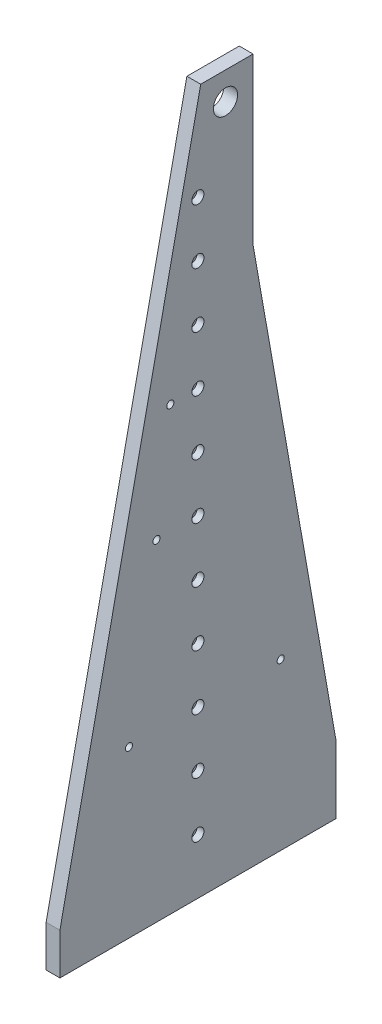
ISO-10303-21;
HEADER;
FILE_DESCRIPTION(('STEP AP214'),'2;1');
FILE_NAME('part.step','',(''),(''),'','','');
FILE_SCHEMA(('AUTOMOTIVE_DESIGN { 1 0 10303 214 1 1 1 1 }'));
ENDSEC;
DATA;
#1=APPLICATION_CONTEXT('core data for automotive mechanical design processes');
#2=APPLICATION_PROTOCOL_DEFINITION('international standard','automotive_design',2000,#1);
#3=PRODUCT_CONTEXT('',#1,'mechanical');
#4=PRODUCT('Part','Part','',(#3));
#5=PRODUCT_RELATED_PRODUCT_CATEGORY('part','',(#4));
#6=PRODUCT_DEFINITION_FORMATION('','',#4);
#7=PRODUCT_DEFINITION_CONTEXT('part definition',#1,'design');
#8=PRODUCT_DEFINITION('design','',#6,#7);
#9=PRODUCT_DEFINITION_SHAPE('','',#8);
#10=(LENGTH_UNIT() NAMED_UNIT(*) SI_UNIT(.MILLI.,.METRE.));
#11=(NAMED_UNIT(*) PLANE_ANGLE_UNIT() SI_UNIT($,.RADIAN.));
#12=(NAMED_UNIT(*) SI_UNIT($,.STERADIAN.) SOLID_ANGLE_UNIT());
#13=UNCERTAINTY_MEASURE_WITH_UNIT(LENGTH_MEASURE(1.E-05),#10,'distance_accuracy_value','');
#14=(GEOMETRIC_REPRESENTATION_CONTEXT(3) GLOBAL_UNCERTAINTY_ASSIGNED_CONTEXT((#13)) GLOBAL_UNIT_ASSIGNED_CONTEXT((#10,
#11,#12)) REPRESENTATION_CONTEXT('',''));
#15=CARTESIAN_POINT('',(0.,0.,0.));
#16=DIRECTION('',(0.,0.,1.));
#17=DIRECTION('',(1.,0.,0.));
#18=AXIS2_PLACEMENT_3D('',#15,#16,#17);
#19=CARTESIAN_POINT('',(12.7,38.1,127.));
#20=DIRECTION('',(0.,-0.20791169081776,-0.978147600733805));
#21=DIRECTION('',(0.,0.978147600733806,-0.20791169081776));
#22=AXIS2_PLACEMENT_3D('',#19,#20,#21);
#23=PLANE('',#22);
#24=DIRECTION('',(0.,-0.978147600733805,0.20791169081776));
#25=VECTOR('',#24,1.);
#26=CARTESIAN_POINT('',(0.,38.1,127.));
#27=LINE('',#26,#25);
#28=CARTESIAN_POINT('',(0.,647.7,-2.57447999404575));
#29=VERTEX_POINT('',#28);
#30=CARTESIAN_POINT('',(0.,38.1,127.));
#31=VERTEX_POINT('',#30);
#32=EDGE_CURVE('E177',#29,#31,#27,.T.);
#33=ORIENTED_EDGE('',*,*,#32,.T.);
#34=DIRECTION('',(-1.,0.,0.));
#35=VECTOR('',#34,1.);
#36=CARTESIAN_POINT('',(12.7,38.1,127.));
#37=LINE('',#36,#35);
#38=CARTESIAN_POINT('',(12.7,38.1,127.));
#39=VERTEX_POINT('',#38);
#40=EDGE_CURVE('E222',#39,#31,#37,.T.);
#41=ORIENTED_EDGE('',*,*,#40,.F.);
#42=DIRECTION('',(0.,-0.978147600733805,0.20791169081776));
#43=VECTOR('',#42,1.);
#44=CARTESIAN_POINT('',(12.7,38.1,127.));
#45=LINE('',#44,#43);
#46=CARTESIAN_POINT('',(12.7,647.7,-2.57447999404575));
#47=VERTEX_POINT('',#46);
#48=EDGE_CURVE('E178',#47,#39,#45,.T.);
#49=ORIENTED_EDGE('',*,*,#48,.F.);
#50=DIRECTION('',(-1.,0.,0.));
#51=VECTOR('',#50,1.);
#52=CARTESIAN_POINT('',(12.7,647.7,-2.57447999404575));
#53=LINE('',#52,#51);
#54=EDGE_CURVE('E194',#47,#29,#53,.T.);
#55=ORIENTED_EDGE('',*,*,#54,.T.);
#56=EDGE_LOOP('',(#33,#41,#49,#55));
#57=FACE_BOUND('',#56,.T.);
#58=ADVANCED_FACE('F36',(#57),#23,.F.);
#59=CARTESIAN_POINT('',(12.7,0.,127.));
#60=DIRECTION('',(0.,0.,-1.));
#61=DIRECTION('',(-1.,0.,0.));
#62=AXIS2_PLACEMENT_3D('',#59,#60,#61);
#63=PLANE('',#62);
#64=DIRECTION('',(0.,-1.,0.));
#65=VECTOR('',#64,1.);
#66=CARTESIAN_POINT('',(0.,0.,127.));
#67=LINE('',#66,#65);
#68=CARTESIAN_POINT('',(0.,0.,127.));
#69=VERTEX_POINT('',#68);
#70=EDGE_CURVE('E197',#31,#69,#67,.T.);
#71=ORIENTED_EDGE('',*,*,#70,.T.);
#72=DIRECTION('',(-1.,0.,0.));
#73=VECTOR('',#72,1.);
#74=CARTESIAN_POINT('',(12.7,0.,127.));
#75=LINE('',#74,#73);
#76=CARTESIAN_POINT('',(12.7,0.,127.));
#77=VERTEX_POINT('',#76);
#78=EDGE_CURVE('E219',#77,#69,#75,.T.);
#79=ORIENTED_EDGE('',*,*,#78,.F.);
#80=DIRECTION('',(0.,-1.,0.));
#81=VECTOR('',#80,1.);
#82=CARTESIAN_POINT('',(12.7,0.,127.));
#83=LINE('',#82,#81);
#84=EDGE_CURVE('E181',#39,#77,#83,.T.);
#85=ORIENTED_EDGE('',*,*,#84,.F.);
#86=ORIENTED_EDGE('',*,*,#40,.T.);
#87=EDGE_LOOP('',(#71,#79,#85,#86));
#88=FACE_BOUND('',#87,.T.);
#89=ADVANCED_FACE('F265',(#88),#63,.F.);
#90=CARTESIAN_POINT('',(12.7,0.,-127.));
#91=DIRECTION('',(0.,1.,0.));
#92=DIRECTION('',(0.,0.,1.));
#93=AXIS2_PLACEMENT_3D('',#90,#91,#92);
#94=PLANE('',#93);
#95=CARTESIAN_POINT('',(6.35,0.,-101.6));
#96=DIRECTION('',(0.,-1.,0.));
#97=DIRECTION('',(0.,0.,-1.));
#98=AXIS2_PLACEMENT_3D('',#95,#96,#97);
#99=CIRCLE('',#98,2.55269999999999);
#100=CARTESIAN_POINT('',(6.35,0.,-104.1527));
#101=VERTEX_POINT('',#100);
#102=EDGE_CURVE('E125',#101,#101,#99,.T.);
#103=ORIENTED_EDGE('',*,*,#102,.F.);
#104=EDGE_LOOP('',(#103));
#105=FACE_BOUND('',#104,.T.);
#106=CARTESIAN_POINT('',(6.34999999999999,0.,-50.8));
#107=DIRECTION('',(0.,-1.,0.));
#108=DIRECTION('',(0.,0.,-1.));
#109=AXIS2_PLACEMENT_3D('',#106,#107,#108);
#110=CIRCLE('',#109,2.55269999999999);
#111=CARTESIAN_POINT('',(6.34999999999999,0.,-53.3527));
#112=VERTEX_POINT('',#111);
#113=EDGE_CURVE('E124',#112,#112,#110,.T.);
#114=ORIENTED_EDGE('',*,*,#113,.F.);
#115=EDGE_LOOP('',(#114));
#116=FACE_BOUND('',#115,.T.);
#117=CARTESIAN_POINT('',(6.34999999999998,0.,0.));
#118=DIRECTION('',(0.,-1.,0.));
#119=DIRECTION('',(0.,0.,-1.));
#120=AXIS2_PLACEMENT_3D('',#117,#118,#119);
#121=CIRCLE('',#120,2.55269999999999);
#122=CARTESIAN_POINT('',(6.34999999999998,0.,-2.55269999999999));
#123=VERTEX_POINT('',#122);
#124=EDGE_CURVE('E137',#123,#123,#121,.T.);
#125=ORIENTED_EDGE('',*,*,#124,.F.);
#126=EDGE_LOOP('',(#125));
#127=FACE_BOUND('',#126,.T.);
#128=CARTESIAN_POINT('',(6.34999999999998,0.,50.8));
#129=DIRECTION('',(0.,-1.,0.));
#130=DIRECTION('',(0.,0.,-1.));
#131=AXIS2_PLACEMENT_3D('',#128,#129,#130);
#132=CIRCLE('',#131,2.55269999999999);
#133=CARTESIAN_POINT('',(6.34999999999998,0.,48.2473));
#134=VERTEX_POINT('',#133);
#135=EDGE_CURVE('E143',#134,#134,#132,.T.);
#136=ORIENTED_EDGE('',*,*,#135,.F.);
#137=EDGE_LOOP('',(#136));
#138=FACE_BOUND('',#137,.T.);
#139=CARTESIAN_POINT('',(6.34999999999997,0.,101.6));
#140=DIRECTION('',(0.,-1.,0.));
#141=DIRECTION('',(0.,0.,-1.));
#142=AXIS2_PLACEMENT_3D('',#139,#140,#141);
#143=CIRCLE('',#142,2.55269999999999);
#144=CARTESIAN_POINT('',(6.34999999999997,0.,99.0473));
#145=VERTEX_POINT('',#144);
#146=EDGE_CURVE('E149',#145,#145,#143,.T.);
#147=ORIENTED_EDGE('',*,*,#146,.F.);
#148=EDGE_LOOP('',(#147));
#149=FACE_BOUND('',#148,.T.);
#150=DIRECTION('',(0.,0.,-1.));
#151=VECTOR('',#150,1.);
#152=CARTESIAN_POINT('',(0.,0.,-127.));
#153=LINE('',#152,#151);
#154=CARTESIAN_POINT('',(0.,0.,-127.));
#155=VERTEX_POINT('',#154);
#156=EDGE_CURVE('E199',#69,#155,#153,.T.);
#157=ORIENTED_EDGE('',*,*,#156,.T.);
#158=DIRECTION('',(-1.,0.,0.));
#159=VECTOR('',#158,1.);
#160=CARTESIAN_POINT('',(12.7,0.,-127.));
#161=LINE('',#160,#159);
#162=CARTESIAN_POINT('',(12.7,0.,-127.));
#163=VERTEX_POINT('',#162);
#164=EDGE_CURVE('E216',#163,#155,#161,.T.);
#165=ORIENTED_EDGE('',*,*,#164,.F.);
#166=DIRECTION('',(0.,0.,-1.));
#167=VECTOR('',#166,1.);
#168=CARTESIAN_POINT('',(12.7,0.,-127.));
#169=LINE('',#168,#167);
#170=EDGE_CURVE('E184',#77,#163,#169,.T.);
#171=ORIENTED_EDGE('',*,*,#170,.F.);
#172=ORIENTED_EDGE('',*,*,#78,.T.);
#173=EDGE_LOOP('',(#157,#165,#171,#172));
#174=FACE_BOUND('',#173,.T.);
#175=ADVANCED_FACE('F269',(#105,#116,#127,#138,#149,#174),#94,.F.);
#176=CARTESIAN_POINT('',(12.7,63.1483253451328,-127.));
#177=DIRECTION('',(0.,0.,1.));
#178=DIRECTION('',(1.,0.,0.));
#179=AXIS2_PLACEMENT_3D('',#176,#177,#178);
#180=PLANE('',#179);
#181=DIRECTION('',(0.,1.,0.));
#182=VECTOR('',#181,1.);
#183=CARTESIAN_POINT('',(0.,63.1483253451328,-127.));
#184=LINE('',#183,#182);
#185=CARTESIAN_POINT('',(0.,63.1483253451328,-127.));
#186=VERTEX_POINT('',#185);
#187=EDGE_CURVE('E201',#155,#186,#184,.T.);
#188=ORIENTED_EDGE('',*,*,#187,.T.);
#189=DIRECTION('',(-1.,0.,0.));
#190=VECTOR('',#189,1.);
#191=CARTESIAN_POINT('',(12.7,63.1483253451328,-127.));
#192=LINE('',#191,#190);
#193=CARTESIAN_POINT('',(12.7,63.1483253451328,-127.));
#194=VERTEX_POINT('',#193);
#195=EDGE_CURVE('E213',#194,#186,#192,.T.);
#196=ORIENTED_EDGE('',*,*,#195,.F.);
#197=DIRECTION('',(0.,1.,0.));
#198=VECTOR('',#197,1.);
#199=CARTESIAN_POINT('',(12.7,63.1483253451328,-127.));
#200=LINE('',#199,#198);
#201=EDGE_CURVE('E186',#163,#194,#200,.T.);
#202=ORIENTED_EDGE('',*,*,#201,.F.);
#203=ORIENTED_EDGE('',*,*,#164,.T.);
#204=EDGE_LOOP('',(#188,#196,#202,#203));
#205=FACE_BOUND('',#204,.T.);
#206=ADVANCED_FACE('F275',(#205),#180,.F.);
#207=CARTESIAN_POINT('',(12.7,495.3,-50.7999999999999));
#208=DIRECTION('',(0.,-0.173648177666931,0.984807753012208));
#209=DIRECTION('',(0.,-0.984807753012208,-0.173648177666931));
#210=AXIS2_PLACEMENT_3D('',#207,#208,#209);
#211=PLANE('',#210);
#212=DIRECTION('',(0.,0.984807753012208,0.173648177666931));
#213=VECTOR('',#212,1.);
#214=CARTESIAN_POINT('',(0.,495.3,-50.7999999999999));
#215=LINE('',#214,#213);
#216=CARTESIAN_POINT('',(0.,494.468388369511,-50.9466355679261));
#217=VERTEX_POINT('',#216);
#218=EDGE_CURVE('E203',#186,#217,#215,.T.);
#219=ORIENTED_EDGE('',*,*,#218,.T.);
#220=DIRECTION('',(-1.,0.,0.));
#221=VECTOR('',#220,1.);
#222=CARTESIAN_POINT('',(12.7,494.468388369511,-50.9466355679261));
#223=LINE('',#222,#221);
#224=CARTESIAN_POINT('',(12.7,494.468388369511,-50.9466355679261));
#225=VERTEX_POINT('',#224);
#226=EDGE_CURVE('E51',#217,#225,#223,.F.);
#227=ORIENTED_EDGE('',*,*,#226,.T.);
#228=DIRECTION('',(0.,0.984807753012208,0.173648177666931));
#229=VECTOR('',#228,1.);
#230=CARTESIAN_POINT('',(12.7,495.3,-50.7999999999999));
#231=LINE('',#230,#229);
#232=EDGE_CURVE('E188',#194,#225,#231,.T.);
#233=ORIENTED_EDGE('',*,*,#232,.F.);
#234=ORIENTED_EDGE('',*,*,#195,.T.);
#235=EDGE_LOOP('',(#219,#227,#233,#234));
#236=FACE_BOUND('',#235,.T.);
#237=ADVANCED_FACE('F279',(#236),#211,.F.);
#238=CARTESIAN_POINT('',(12.7,647.7,-50.7999999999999));
#239=DIRECTION('',(0.,0.,1.));
#240=DIRECTION('',(0.,-1.,0.));
#241=AXIS2_PLACEMENT_3D('',#238,#239,#240);
#242=PLANE('',#241);
#243=DIRECTION('',(0.,1.,0.));
#244=VECTOR('',#243,1.);
#245=CARTESIAN_POINT('',(12.7,647.7,-50.7999999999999));
#246=LINE('',#245,#244);
#247=CARTESIAN_POINT('',(12.7,496.144440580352,-50.7999999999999));
#248=VERTEX_POINT('',#247);
#249=CARTESIAN_POINT('',(12.7,647.7,-50.7999999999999));
#250=VERTEX_POINT('',#249);
#251=EDGE_CURVE('E190',#248,#250,#246,.T.);
#252=ORIENTED_EDGE('',*,*,#251,.F.);
#253=DIRECTION('',(-1.,0.,0.));
#254=VECTOR('',#253,1.);
#255=CARTESIAN_POINT('',(0.,496.144440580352,-50.7999999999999));
#256=LINE('',#255,#254);
#257=CARTESIAN_POINT('',(0.,496.144440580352,-50.7999999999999));
#258=VERTEX_POINT('',#257);
#259=EDGE_CURVE('E225',#248,#258,#256,.T.);
#260=ORIENTED_EDGE('',*,*,#259,.T.);
#261=DIRECTION('',(0.,1.,0.));
#262=VECTOR('',#261,1.);
#263=CARTESIAN_POINT('',(0.,647.7,-50.7999999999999));
#264=LINE('',#263,#262);
#265=CARTESIAN_POINT('',(0.,647.7,-50.7999999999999));
#266=VERTEX_POINT('',#265);
#267=EDGE_CURVE('E205',#258,#266,#264,.T.);
#268=ORIENTED_EDGE('',*,*,#267,.T.);
#269=DIRECTION('',(-1.,0.,0.));
#270=VECTOR('',#269,1.);
#271=CARTESIAN_POINT('',(12.7,647.7,-50.7999999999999));
#272=LINE('',#271,#270);
#273=EDGE_CURVE('E210',#250,#266,#272,.T.);
#274=ORIENTED_EDGE('',*,*,#273,.F.);
#275=EDGE_LOOP('',(#252,#260,#268,#274));
#276=FACE_BOUND('',#275,.T.);
#277=ADVANCED_FACE('F239',(#276),#242,.F.);
#278=CARTESIAN_POINT('',(12.7,647.7,-2.57447999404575));
#279=DIRECTION('',(0.,-1.,0.));
#280=DIRECTION('',(0.,0.,-1.));
#281=AXIS2_PLACEMENT_3D('',#278,#279,#280);
#282=PLANE('',#281);
#283=DIRECTION('',(0.,0.,1.));
#284=VECTOR('',#283,1.);
#285=CARTESIAN_POINT('',(0.,647.7,-2.57447999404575));
#286=LINE('',#285,#284);
#287=EDGE_CURVE('E182',#266,#29,#286,.T.);
#288=ORIENTED_EDGE('',*,*,#287,.T.);
#289=ORIENTED_EDGE('',*,*,#54,.F.);
#290=DIRECTION('',(0.,0.,1.));
#291=VECTOR('',#290,1.);
#292=CARTESIAN_POINT('',(12.7,647.7,-2.57447999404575));
#293=LINE('',#292,#291);
#294=EDGE_CURVE('E192',#250,#47,#293,.T.);
#295=ORIENTED_EDGE('',*,*,#294,.F.);
#296=ORIENTED_EDGE('',*,*,#273,.T.);
#297=EDGE_LOOP('',(#288,#289,#295,#296));
#298=FACE_BOUND('',#297,.T.);
#299=ADVANCED_FACE('F248',(#298),#282,.F.);
#300=CARTESIAN_POINT('',(12.7,0.,0.));
#301=DIRECTION('',(-1.,0.,0.));
#302=DIRECTION('',(0.,0.,1.));
#303=AXIS2_PLACEMENT_3D('',#300,#301,#302);
#304=PLANE('',#303);
#305=CARTESIAN_POINT('',(12.7,558.8,0.));
#306=DIRECTION('',(1.,0.,0.));
#307=DIRECTION('',(0.,0.,-1.));
#308=AXIS2_PLACEMENT_3D('',#305,#306,#307);
#309=CIRCLE('',#308,5.55625000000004);
#310=CARTESIAN_POINT('',(12.7,558.8,-5.55625000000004));
#311=VERTEX_POINT('',#310);
#312=EDGE_CURVE('E481',#311,#311,#309,.T.);
#313=ORIENTED_EDGE('',*,*,#312,.F.);
#314=EDGE_LOOP('',(#313));
#315=FACE_BOUND('',#314,.T.);
#316=CARTESIAN_POINT('',(12.7,508.,0.));
#317=DIRECTION('',(1.,0.,0.));
#318=DIRECTION('',(0.,0.,-1.));
#319=AXIS2_PLACEMENT_3D('',#316,#317,#318);
#320=CIRCLE('',#319,5.55625000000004);
#321=CARTESIAN_POINT('',(12.7,508.,-5.55625000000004));
#322=VERTEX_POINT('',#321);
#323=EDGE_CURVE('E490',#322,#322,#320,.T.);
#324=ORIENTED_EDGE('',*,*,#323,.F.);
#325=EDGE_LOOP('',(#324));
#326=FACE_BOUND('',#325,.T.);
#327=CARTESIAN_POINT('',(12.7,457.2,0.));
#328=DIRECTION('',(1.,0.,0.));
#329=DIRECTION('',(0.,0.,-1.));
#330=AXIS2_PLACEMENT_3D('',#327,#328,#329);
#331=CIRCLE('',#330,5.55624999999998);
#332=CARTESIAN_POINT('',(12.7,457.2,-5.55624999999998));
#333=VERTEX_POINT('',#332);
#334=EDGE_CURVE('E502',#333,#333,#331,.T.);
#335=ORIENTED_EDGE('',*,*,#334,.F.);
#336=EDGE_LOOP('',(#335));
#337=FACE_BOUND('',#336,.T.);
#338=CARTESIAN_POINT('',(12.7,406.4,0.));
#339=DIRECTION('',(1.,0.,0.));
#340=DIRECTION('',(0.,0.,-1.));
#341=AXIS2_PLACEMENT_3D('',#338,#339,#340);
#342=CIRCLE('',#341,5.55624999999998);
#343=CARTESIAN_POINT('',(12.7,406.4,-5.55624999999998));
#344=VERTEX_POINT('',#343);
#345=EDGE_CURVE('E514',#344,#344,#342,.T.);
#346=ORIENTED_EDGE('',*,*,#345,.F.);
#347=EDGE_LOOP('',(#346));
#348=FACE_BOUND('',#347,.T.);
#349=CARTESIAN_POINT('',(12.7,355.6,0.));
#350=DIRECTION('',(1.,0.,0.));
#351=DIRECTION('',(0.,0.,-1.));
#352=AXIS2_PLACEMENT_3D('',#349,#350,#351);
#353=CIRCLE('',#352,5.55624999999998);
#354=CARTESIAN_POINT('',(12.7,355.6,-5.55624999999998));
#355=VERTEX_POINT('',#354);
#356=EDGE_CURVE('E526',#355,#355,#353,.T.);
#357=ORIENTED_EDGE('',*,*,#356,.F.);
#358=EDGE_LOOP('',(#357));
#359=FACE_BOUND('',#358,.T.);
#360=CARTESIAN_POINT('',(12.7,304.8,0.));
#361=DIRECTION('',(1.,0.,0.));
#362=DIRECTION('',(0.,0.,-1.));
#363=AXIS2_PLACEMENT_3D('',#360,#361,#362);
#364=CIRCLE('',#363,5.55624999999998);
#365=CARTESIAN_POINT('',(12.7,304.8,-5.55624999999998));
#366=VERTEX_POINT('',#365);
#367=EDGE_CURVE('E538',#366,#366,#364,.T.);
#368=ORIENTED_EDGE('',*,*,#367,.F.);
#369=EDGE_LOOP('',(#368));
#370=FACE_BOUND('',#369,.T.);
#371=CARTESIAN_POINT('',(12.7,254.,0.));
#372=DIRECTION('',(1.,0.,0.));
#373=DIRECTION('',(0.,0.,-1.));
#374=AXIS2_PLACEMENT_3D('',#371,#372,#373);
#375=CIRCLE('',#374,5.55624999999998);
#376=CARTESIAN_POINT('',(12.7,254.,-5.55624999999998));
#377=VERTEX_POINT('',#376);
#378=EDGE_CURVE('E550',#377,#377,#375,.T.);
#379=ORIENTED_EDGE('',*,*,#378,.F.);
#380=EDGE_LOOP('',(#379));
#381=FACE_BOUND('',#380,.T.);
#382=CARTESIAN_POINT('',(12.7,203.2,0.));
#383=DIRECTION('',(1.,0.,0.));
#384=DIRECTION('',(0.,0.,-1.));
#385=AXIS2_PLACEMENT_3D('',#382,#383,#384);
#386=CIRCLE('',#385,5.55624999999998);
#387=CARTESIAN_POINT('',(12.7,203.2,-5.55624999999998));
#388=VERTEX_POINT('',#387);
#389=EDGE_CURVE('E562',#388,#388,#386,.T.);
#390=ORIENTED_EDGE('',*,*,#389,.F.);
#391=EDGE_LOOP('',(#390));
#392=FACE_BOUND('',#391,.T.);
#393=CARTESIAN_POINT('',(12.7,152.4,0.));
#394=DIRECTION('',(1.,0.,0.));
#395=DIRECTION('',(0.,0.,-1.));
#396=AXIS2_PLACEMENT_3D('',#393,#394,#395);
#397=CIRCLE('',#396,5.55624999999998);
#398=CARTESIAN_POINT('',(12.7,152.4,-5.55624999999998));
#399=VERTEX_POINT('',#398);
#400=EDGE_CURVE('E574',#399,#399,#397,.T.);
#401=ORIENTED_EDGE('',*,*,#400,.F.);
#402=EDGE_LOOP('',(#401));
#403=FACE_BOUND('',#402,.T.);
#404=CARTESIAN_POINT('',(12.7,101.6,0.));
#405=DIRECTION('',(1.,0.,0.));
#406=DIRECTION('',(0.,0.,-1.));
#407=AXIS2_PLACEMENT_3D('',#404,#405,#406);
#408=CIRCLE('',#407,5.55625);
#409=CARTESIAN_POINT('',(12.7,101.6,-5.55625));
#410=VERTEX_POINT('',#409);
#411=EDGE_CURVE('E586',#410,#410,#408,.T.);
#412=ORIENTED_EDGE('',*,*,#411,.F.);
#413=EDGE_LOOP('',(#412));
#414=FACE_BOUND('',#413,.T.);
#415=CARTESIAN_POINT('',(12.7,50.8,0.));
#416=DIRECTION('',(1.,0.,0.));
#417=DIRECTION('',(0.,0.,-1.));
#418=AXIS2_PLACEMENT_3D('',#415,#416,#417);
#419=CIRCLE('',#418,5.55625);
#420=CARTESIAN_POINT('',(12.7,50.8,-5.55625));
#421=VERTEX_POINT('',#420);
#422=EDGE_CURVE('E598',#421,#421,#419,.T.);
#423=ORIENTED_EDGE('',*,*,#422,.F.);
#424=EDGE_LOOP('',(#423));
#425=FACE_BOUND('',#424,.T.);
#426=CARTESIAN_POINT('',(12.7,406.4,25.4));
#427=DIRECTION('',(1.,0.,0.));
#428=DIRECTION('',(0.,0.,-1.));
#429=AXIS2_PLACEMENT_3D('',#426,#427,#428);
#430=CIRCLE('',#429,3.26389999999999);
#431=CARTESIAN_POINT('',(12.7,406.4,22.1361));
#432=VERTEX_POINT('',#431);
#433=EDGE_CURVE('E155',#432,#432,#430,.T.);
#434=ORIENTED_EDGE('',*,*,#433,.F.);
#435=EDGE_LOOP('',(#434));
#436=FACE_BOUND('',#435,.T.);
#437=CARTESIAN_POINT('',(12.7,304.8,38.1));
#438=DIRECTION('',(1.,0.,0.));
#439=DIRECTION('',(0.,0.,-1.));
#440=AXIS2_PLACEMENT_3D('',#437,#438,#439);
#441=CIRCLE('',#440,3.26389999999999);
#442=CARTESIAN_POINT('',(12.7,304.8,34.8361));
#443=VERTEX_POINT('',#442);
#444=EDGE_CURVE('E159',#443,#443,#441,.T.);
#445=ORIENTED_EDGE('',*,*,#444,.F.);
#446=EDGE_LOOP('',(#445));
#447=FACE_BOUND('',#446,.T.);
#448=CARTESIAN_POINT('',(12.7,152.4,63.5));
#449=DIRECTION('',(1.,0.,0.));
#450=DIRECTION('',(0.,0.,-1.));
#451=AXIS2_PLACEMENT_3D('',#448,#449,#450);
#452=CIRCLE('',#451,3.26389999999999);
#453=CARTESIAN_POINT('',(12.7,152.4,60.2361));
#454=VERTEX_POINT('',#453);
#455=EDGE_CURVE('E163',#454,#454,#452,.T.);
#456=ORIENTED_EDGE('',*,*,#455,.F.);
#457=EDGE_LOOP('',(#456));
#458=FACE_BOUND('',#457,.T.);
#459=CARTESIAN_POINT('',(12.7,152.4,-76.2));
#460=DIRECTION('',(1.,0.,0.));
#461=DIRECTION('',(0.,0.,-1.));
#462=AXIS2_PLACEMENT_3D('',#459,#460,#461);
#463=CIRCLE('',#462,3.26389999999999);
#464=CARTESIAN_POINT('',(12.7,152.4,-79.4639));
#465=VERTEX_POINT('',#464);
#466=EDGE_CURVE('E167',#465,#465,#463,.T.);
#467=ORIENTED_EDGE('',*,*,#466,.F.);
#468=EDGE_LOOP('',(#467));
#469=FACE_BOUND('',#468,.T.);
#470=CARTESIAN_POINT('',(12.7,622.3,-25.3999999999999));
#471=DIRECTION('',(1.,0.,0.));
#472=DIRECTION('',(0.,0.,-1.));
#473=AXIS2_PLACEMENT_3D('',#470,#471,#472);
#474=CIRCLE('',#473,11.1125);
#475=CARTESIAN_POINT('',(12.7,622.3,-36.5124999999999));
#476=VERTEX_POINT('',#475);
#477=EDGE_CURVE('E171',#476,#476,#474,.T.);
#478=ORIENTED_EDGE('',*,*,#477,.F.);
#479=EDGE_LOOP('',(#478));
#480=FACE_BOUND('',#479,.T.);
#481=ORIENTED_EDGE('',*,*,#48,.T.);
#482=ORIENTED_EDGE('',*,*,#84,.T.);
#483=ORIENTED_EDGE('',*,*,#170,.T.);
#484=ORIENTED_EDGE('',*,*,#201,.T.);
#485=ORIENTED_EDGE('',*,*,#232,.T.);
#486=CARTESIAN_POINT('',(12.7,496.144440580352,-60.4519999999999));
#487=DIRECTION('',(-1.,0.,0.));
#488=DIRECTION('',(0.,0.,1.));
#489=AXIS2_PLACEMENT_3D('',#486,#487,#488);
#490=CIRCLE('',#489,9.652);
#491=EDGE_CURVE('E11',#225,#248,#490,.T.);
#492=ORIENTED_EDGE('',*,*,#491,.T.);
#493=ORIENTED_EDGE('',*,*,#251,.T.);
#494=ORIENTED_EDGE('',*,*,#294,.T.);
#495=EDGE_LOOP('',(#481,#482,#483,#484,#485,#492,#493,#494));
#496=FACE_BOUND('',#495,.T.);
#497=ADVANCED_FACE('F254',(#315,#326,#337,#348,#359,#370,#381,#392,#403,#414,#425,#436,#447,
#458,#469,#480,#496),#304,.F.);
#498=CARTESIAN_POINT('',(0.,0.,0.));
#499=DIRECTION('',(-1.,0.,0.));
#500=DIRECTION('',(0.,0.,1.));
#501=AXIS2_PLACEMENT_3D('',#498,#499,#500);
#502=PLANE('',#501);
#503=CARTESIAN_POINT('',(0.,558.8,0.));
#504=DIRECTION('',(1.,0.,0.));
#505=DIRECTION('',(0.,0.,-1.));
#506=AXIS2_PLACEMENT_3D('',#503,#504,#505);
#507=CIRCLE('',#506,3.26389999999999);
#508=CARTESIAN_POINT('',(0.,558.8,-3.26389999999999));
#509=VERTEX_POINT('',#508);
#510=EDGE_CURVE('E483',#509,#509,#507,.T.);
#511=ORIENTED_EDGE('',*,*,#510,.T.);
#512=EDGE_LOOP('',(#511));
#513=FACE_BOUND('',#512,.T.);
#514=CARTESIAN_POINT('',(0.,508.,0.));
#515=DIRECTION('',(1.,0.,0.));
#516=DIRECTION('',(0.,0.,-1.));
#517=AXIS2_PLACEMENT_3D('',#514,#515,#516);
#518=CIRCLE('',#517,3.26389999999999);
#519=CARTESIAN_POINT('',(0.,508.,-3.26389999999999));
#520=VERTEX_POINT('',#519);
#521=EDGE_CURVE('E499',#520,#520,#518,.T.);
#522=ORIENTED_EDGE('',*,*,#521,.T.);
#523=EDGE_LOOP('',(#522));
#524=FACE_BOUND('',#523,.T.);
#525=CARTESIAN_POINT('',(0.,457.2,0.));
#526=DIRECTION('',(1.,0.,0.));
#527=DIRECTION('',(0.,0.,-1.));
#528=AXIS2_PLACEMENT_3D('',#525,#526,#527);
#529=CIRCLE('',#528,3.26389999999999);
#530=CARTESIAN_POINT('',(0.,457.2,-3.26389999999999));
#531=VERTEX_POINT('',#530);
#532=EDGE_CURVE('E511',#531,#531,#529,.T.);
#533=ORIENTED_EDGE('',*,*,#532,.T.);
#534=EDGE_LOOP('',(#533));
#535=FACE_BOUND('',#534,.T.);
#536=CARTESIAN_POINT('',(0.,406.4,0.));
#537=DIRECTION('',(1.,0.,0.));
#538=DIRECTION('',(0.,0.,-1.));
#539=AXIS2_PLACEMENT_3D('',#536,#537,#538);
#540=CIRCLE('',#539,3.26389999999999);
#541=CARTESIAN_POINT('',(0.,406.4,-3.26389999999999));
#542=VERTEX_POINT('',#541);
#543=EDGE_CURVE('E523',#542,#542,#540,.T.);
#544=ORIENTED_EDGE('',*,*,#543,.T.);
#545=EDGE_LOOP('',(#544));
#546=FACE_BOUND('',#545,.T.);
#547=CARTESIAN_POINT('',(0.,355.6,0.));
#548=DIRECTION('',(1.,0.,0.));
#549=DIRECTION('',(0.,0.,-1.));
#550=AXIS2_PLACEMENT_3D('',#547,#548,#549);
#551=CIRCLE('',#550,3.26389999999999);
#552=CARTESIAN_POINT('',(0.,355.6,-3.26389999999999));
#553=VERTEX_POINT('',#552);
#554=EDGE_CURVE('E535',#553,#553,#551,.T.);
#555=ORIENTED_EDGE('',*,*,#554,.T.);
#556=EDGE_LOOP('',(#555));
#557=FACE_BOUND('',#556,.T.);
#558=CARTESIAN_POINT('',(0.,304.8,0.));
#559=DIRECTION('',(1.,0.,0.));
#560=DIRECTION('',(0.,0.,-1.));
#561=AXIS2_PLACEMENT_3D('',#558,#559,#560);
#562=CIRCLE('',#561,3.26389999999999);
#563=CARTESIAN_POINT('',(0.,304.8,-3.26389999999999));
#564=VERTEX_POINT('',#563);
#565=EDGE_CURVE('E547',#564,#564,#562,.T.);
#566=ORIENTED_EDGE('',*,*,#565,.T.);
#567=EDGE_LOOP('',(#566));
#568=FACE_BOUND('',#567,.T.);
#569=CARTESIAN_POINT('',(0.,254.,0.));
#570=DIRECTION('',(1.,0.,0.));
#571=DIRECTION('',(0.,0.,-1.));
#572=AXIS2_PLACEMENT_3D('',#569,#570,#571);
#573=CIRCLE('',#572,3.26389999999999);
#574=CARTESIAN_POINT('',(0.,254.,-3.26389999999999));
#575=VERTEX_POINT('',#574);
#576=EDGE_CURVE('E559',#575,#575,#573,.T.);
#577=ORIENTED_EDGE('',*,*,#576,.T.);
#578=EDGE_LOOP('',(#577));
#579=FACE_BOUND('',#578,.T.);
#580=CARTESIAN_POINT('',(0.,203.2,0.));
#581=DIRECTION('',(1.,0.,0.));
#582=DIRECTION('',(0.,0.,-1.));
#583=AXIS2_PLACEMENT_3D('',#580,#581,#582);
#584=CIRCLE('',#583,3.26389999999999);
#585=CARTESIAN_POINT('',(0.,203.2,-3.26389999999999));
#586=VERTEX_POINT('',#585);
#587=EDGE_CURVE('E571',#586,#586,#584,.T.);
#588=ORIENTED_EDGE('',*,*,#587,.T.);
#589=EDGE_LOOP('',(#588));
#590=FACE_BOUND('',#589,.T.);
#591=CARTESIAN_POINT('',(0.,152.4,0.));
#592=DIRECTION('',(1.,0.,0.));
#593=DIRECTION('',(0.,0.,-1.));
#594=AXIS2_PLACEMENT_3D('',#591,#592,#593);
#595=CIRCLE('',#594,3.26389999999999);
#596=CARTESIAN_POINT('',(0.,152.4,-3.26389999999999));
#597=VERTEX_POINT('',#596);
#598=EDGE_CURVE('E583',#597,#597,#595,.T.);
#599=ORIENTED_EDGE('',*,*,#598,.T.);
#600=EDGE_LOOP('',(#599));
#601=FACE_BOUND('',#600,.T.);
#602=CARTESIAN_POINT('',(0.,101.6,0.));
#603=DIRECTION('',(1.,0.,0.));
#604=DIRECTION('',(0.,0.,-1.));
#605=AXIS2_PLACEMENT_3D('',#602,#603,#604);
#606=CIRCLE('',#605,3.2639);
#607=CARTESIAN_POINT('',(0.,101.6,-3.2639));
#608=VERTEX_POINT('',#607);
#609=EDGE_CURVE('E595',#608,#608,#606,.T.);
#610=ORIENTED_EDGE('',*,*,#609,.T.);
#611=EDGE_LOOP('',(#610));
#612=FACE_BOUND('',#611,.T.);
#613=CARTESIAN_POINT('',(0.,50.8,0.));
#614=DIRECTION('',(1.,0.,0.));
#615=DIRECTION('',(0.,0.,-1.));
#616=AXIS2_PLACEMENT_3D('',#613,#614,#615);
#617=CIRCLE('',#616,3.2639);
#618=CARTESIAN_POINT('',(0.,50.8,-3.2639));
#619=VERTEX_POINT('',#618);
#620=EDGE_CURVE('E131',#619,#619,#617,.T.);
#621=ORIENTED_EDGE('',*,*,#620,.T.);
#622=EDGE_LOOP('',(#621));
#623=FACE_BOUND('',#622,.T.);
#624=CARTESIAN_POINT('',(0.,406.4,25.4));
#625=DIRECTION('',(-1.,0.,0.));
#626=DIRECTION('',(0.,0.,1.));
#627=AXIS2_PLACEMENT_3D('',#624,#625,#626);
#628=CIRCLE('',#627,3.26389999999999);
#629=CARTESIAN_POINT('',(0.,406.4,28.6639));
#630=VERTEX_POINT('',#629);
#631=EDGE_CURVE('E158',#630,#630,#628,.T.);
#632=ORIENTED_EDGE('',*,*,#631,.F.);
#633=EDGE_LOOP('',(#632));
#634=FACE_BOUND('',#633,.T.);
#635=CARTESIAN_POINT('',(0.,304.8,38.1));
#636=DIRECTION('',(-1.,0.,0.));
#637=DIRECTION('',(0.,0.,1.));
#638=AXIS2_PLACEMENT_3D('',#635,#636,#637);
#639=CIRCLE('',#638,3.26389999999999);
#640=CARTESIAN_POINT('',(0.,304.8,41.3639));
#641=VERTEX_POINT('',#640);
#642=EDGE_CURVE('E162',#641,#641,#639,.T.);
#643=ORIENTED_EDGE('',*,*,#642,.F.);
#644=EDGE_LOOP('',(#643));
#645=FACE_BOUND('',#644,.T.);
#646=CARTESIAN_POINT('',(0.,152.4,63.5));
#647=DIRECTION('',(-1.,0.,0.));
#648=DIRECTION('',(0.,0.,1.));
#649=AXIS2_PLACEMENT_3D('',#646,#647,#648);
#650=CIRCLE('',#649,3.26389999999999);
#651=CARTESIAN_POINT('',(0.,152.4,66.7639));
#652=VERTEX_POINT('',#651);
#653=EDGE_CURVE('E166',#652,#652,#650,.T.);
#654=ORIENTED_EDGE('',*,*,#653,.F.);
#655=EDGE_LOOP('',(#654));
#656=FACE_BOUND('',#655,.T.);
#657=CARTESIAN_POINT('',(0.,152.4,-76.2));
#658=DIRECTION('',(-1.,0.,0.));
#659=DIRECTION('',(0.,0.,1.));
#660=AXIS2_PLACEMENT_3D('',#657,#658,#659);
#661=CIRCLE('',#660,3.26389999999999);
#662=CARTESIAN_POINT('',(0.,152.4,-72.9361));
#663=VERTEX_POINT('',#662);
#664=EDGE_CURVE('E170',#663,#663,#661,.T.);
#665=ORIENTED_EDGE('',*,*,#664,.F.);
#666=EDGE_LOOP('',(#665));
#667=FACE_BOUND('',#666,.T.);
#668=CARTESIAN_POINT('',(0.,622.3,-25.3999999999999));
#669=DIRECTION('',(1.,0.,0.));
#670=DIRECTION('',(0.,0.,-1.));
#671=AXIS2_PLACEMENT_3D('',#668,#669,#670);
#672=CIRCLE('',#671,11.1125);
#673=CARTESIAN_POINT('',(0.,622.3,-36.5124999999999));
#674=VERTEX_POINT('',#673);
#675=EDGE_CURVE('E174',#674,#674,#672,.T.);
#676=ORIENTED_EDGE('',*,*,#675,.T.);
#677=EDGE_LOOP('',(#676));
#678=FACE_BOUND('',#677,.T.);
#679=ORIENTED_EDGE('',*,*,#32,.F.);
#680=ORIENTED_EDGE('',*,*,#287,.F.);
#681=ORIENTED_EDGE('',*,*,#267,.F.);
#682=CARTESIAN_POINT('',(0.,496.144440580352,-60.4519999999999));
#683=DIRECTION('',(-1.,0.,0.));
#684=DIRECTION('',(0.,0.,1.));
#685=AXIS2_PLACEMENT_3D('',#682,#683,#684);
#686=CIRCLE('',#685,9.652);
#687=EDGE_CURVE('E44',#258,#217,#686,.F.);
#688=ORIENTED_EDGE('',*,*,#687,.T.);
#689=ORIENTED_EDGE('',*,*,#218,.F.);
#690=ORIENTED_EDGE('',*,*,#187,.F.);
#691=ORIENTED_EDGE('',*,*,#156,.F.);
#692=ORIENTED_EDGE('',*,*,#70,.F.);
#693=EDGE_LOOP('',(#679,#680,#681,#688,#689,#690,#691,#692));
#694=FACE_BOUND('',#693,.T.);
#695=ADVANCED_FACE('F245',(#513,#524,#535,#546,#557,#568,#579,#590,#601,#612,#623,#634,#645,
#656,#667,#678,#694),#502,.T.);
#696=CARTESIAN_POINT('',(12.7,622.3,-25.3999999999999));
#697=DIRECTION('',(1.,0.,0.));
#698=DIRECTION('',(0.,0.,-1.));
#699=AXIS2_PLACEMENT_3D('',#696,#697,#698);
#700=CYLINDRICAL_SURFACE('',#699,11.1125);
#701=ORIENTED_EDGE('',*,*,#675,.F.);
#702=EDGE_LOOP('',(#701));
#703=FACE_BOUND('',#702,.T.);
#704=ORIENTED_EDGE('',*,*,#477,.T.);
#705=EDGE_LOOP('',(#704));
#706=FACE_BOUND('',#705,.T.);
#707=ADVANCED_FACE('F289',(#703,#706),#700,.F.);
#708=CARTESIAN_POINT('',(12.7,152.4,-76.2));
#709=DIRECTION('',(1.,0.,0.));
#710=DIRECTION('',(0.,0.,-1.));
#711=AXIS2_PLACEMENT_3D('',#708,#709,#710);
#712=CYLINDRICAL_SURFACE('',#711,3.26389999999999);
#713=ORIENTED_EDGE('',*,*,#664,.T.);
#714=EDGE_LOOP('',(#713));
#715=FACE_BOUND('',#714,.T.);
#716=ORIENTED_EDGE('',*,*,#466,.T.);
#717=EDGE_LOOP('',(#716));
#718=FACE_BOUND('',#717,.T.);
#719=ADVANCED_FACE('F296',(#715,#718),#712,.F.);
#720=CARTESIAN_POINT('',(12.7,152.4,63.5));
#721=DIRECTION('',(1.,0.,0.));
#722=DIRECTION('',(0.,0.,-1.));
#723=AXIS2_PLACEMENT_3D('',#720,#721,#722);
#724=CYLINDRICAL_SURFACE('',#723,3.26389999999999);
#725=ORIENTED_EDGE('',*,*,#653,.T.);
#726=EDGE_LOOP('',(#725));
#727=FACE_BOUND('',#726,.T.);
#728=ORIENTED_EDGE('',*,*,#455,.T.);
#729=EDGE_LOOP('',(#728));
#730=FACE_BOUND('',#729,.T.);
#731=ADVANCED_FACE('F300',(#727,#730),#724,.F.);
#732=CARTESIAN_POINT('',(12.7,304.8,38.1));
#733=DIRECTION('',(1.,0.,0.));
#734=DIRECTION('',(0.,0.,-1.));
#735=AXIS2_PLACEMENT_3D('',#732,#733,#734);
#736=CYLINDRICAL_SURFACE('',#735,3.26389999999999);
#737=ORIENTED_EDGE('',*,*,#642,.T.);
#738=EDGE_LOOP('',(#737));
#739=FACE_BOUND('',#738,.T.);
#740=ORIENTED_EDGE('',*,*,#444,.T.);
#741=EDGE_LOOP('',(#740));
#742=FACE_BOUND('',#741,.T.);
#743=ADVANCED_FACE('F304',(#739,#742),#736,.F.);
#744=CARTESIAN_POINT('',(12.7,406.4,25.4));
#745=DIRECTION('',(1.,0.,0.));
#746=DIRECTION('',(0.,0.,-1.));
#747=AXIS2_PLACEMENT_3D('',#744,#745,#746);
#748=CYLINDRICAL_SURFACE('',#747,3.26389999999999);
#749=ORIENTED_EDGE('',*,*,#631,.T.);
#750=EDGE_LOOP('',(#749));
#751=FACE_BOUND('',#750,.T.);
#752=ORIENTED_EDGE('',*,*,#433,.T.);
#753=EDGE_LOOP('',(#752));
#754=FACE_BOUND('',#753,.T.);
#755=ADVANCED_FACE('F308',(#751,#754),#748,.F.);
#756=CARTESIAN_POINT('',(6.34999999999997,13.335,101.6));
#757=DIRECTION('',(0.,-1.,0.));
#758=DIRECTION('',(0.,0.,-1.));
#759=AXIS2_PLACEMENT_3D('',#756,#757,#758);
#760=CONICAL_SURFACE('',#759,2.55269999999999,1.02974425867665);
#761=CARTESIAN_POINT('',(6.34999999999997,14.8688169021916,101.6));
#762=VERTEX_POINT('',#761);
#763=VERTEX_LOOP('',#762);
#764=FACE_BOUND('',#763,.T.);
#765=CARTESIAN_POINT('',(6.34999999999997,13.335,101.6));
#766=DIRECTION('',(0.,-1.,0.));
#767=DIRECTION('',(0.,0.,-1.));
#768=AXIS2_PLACEMENT_3D('',#765,#766,#767);
#769=CIRCLE('',#768,2.55269999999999);
#770=CARTESIAN_POINT('',(6.34999999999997,13.335,99.0473));
#771=VERTEX_POINT('',#770);
#772=EDGE_CURVE('E152',#771,#771,#769,.T.);
#773=ORIENTED_EDGE('',*,*,#772,.T.);
#774=EDGE_LOOP('',(#773));
#775=FACE_BOUND('',#774,.T.);
#776=ADVANCED_FACE('F312',(#764,#775),#760,.F.);
#777=CARTESIAN_POINT('',(6.34999999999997,0.,101.6));
#778=DIRECTION('',(0.,-1.,0.));
#779=DIRECTION('',(0.,0.,-1.));
#780=AXIS2_PLACEMENT_3D('',#777,#778,#779);
#781=CYLINDRICAL_SURFACE('',#780,2.55269999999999);
#782=ORIENTED_EDGE('',*,*,#772,.F.);
#783=EDGE_LOOP('',(#782));
#784=FACE_BOUND('',#783,.T.);
#785=ORIENTED_EDGE('',*,*,#146,.T.);
#786=EDGE_LOOP('',(#785));
#787=FACE_BOUND('',#786,.T.);
#788=ADVANCED_FACE('F316',(#784,#787),#781,.F.);
#789=CARTESIAN_POINT('',(6.34999999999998,13.335,50.8));
#790=DIRECTION('',(0.,-1.,0.));
#791=DIRECTION('',(0.,0.,-1.));
#792=AXIS2_PLACEMENT_3D('',#789,#790,#791);
#793=CONICAL_SURFACE('',#792,2.55269999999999,1.02974425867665);
#794=CARTESIAN_POINT('',(6.34999999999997,14.8688169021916,50.8));
#795=VERTEX_POINT('',#794);
#796=VERTEX_LOOP('',#795);
#797=FACE_BOUND('',#796,.T.);
#798=CARTESIAN_POINT('',(6.34999999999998,13.335,50.8));
#799=DIRECTION('',(0.,-1.,0.));
#800=DIRECTION('',(0.,0.,-1.));
#801=AXIS2_PLACEMENT_3D('',#798,#799,#800);
#802=CIRCLE('',#801,2.55269999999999);
#803=CARTESIAN_POINT('',(6.34999999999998,13.335,48.2473));
#804=VERTEX_POINT('',#803);
#805=EDGE_CURVE('E146',#804,#804,#802,.T.);
#806=ORIENTED_EDGE('',*,*,#805,.T.);
#807=EDGE_LOOP('',(#806));
#808=FACE_BOUND('',#807,.T.);
#809=ADVANCED_FACE('F320',(#797,#808),#793,.F.);
#810=CARTESIAN_POINT('',(6.34999999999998,0.,50.8));
#811=DIRECTION('',(0.,-1.,0.));
#812=DIRECTION('',(0.,0.,-1.));
#813=AXIS2_PLACEMENT_3D('',#810,#811,#812);
#814=CYLINDRICAL_SURFACE('',#813,2.55269999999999);
#815=ORIENTED_EDGE('',*,*,#805,.F.);
#816=EDGE_LOOP('',(#815));
#817=FACE_BOUND('',#816,.T.);
#818=ORIENTED_EDGE('',*,*,#135,.T.);
#819=EDGE_LOOP('',(#818));
#820=FACE_BOUND('',#819,.T.);
#821=ADVANCED_FACE('F324',(#817,#820),#814,.F.);
#822=CARTESIAN_POINT('',(6.34999999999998,13.335,0.));
#823=DIRECTION('',(0.,-1.,0.));
#824=DIRECTION('',(0.,0.,-1.));
#825=AXIS2_PLACEMENT_3D('',#822,#823,#824);
#826=CONICAL_SURFACE('',#825,2.55269999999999,1.02974425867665);
#827=CARTESIAN_POINT('',(6.34999999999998,14.8688169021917,0.));
#828=VERTEX_POINT('',#827);
#829=VERTEX_LOOP('',#828);
#830=FACE_BOUND('',#829,.T.);
#831=CARTESIAN_POINT('',(6.34999999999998,13.335,0.));
#832=DIRECTION('',(0.,-1.,0.));
#833=DIRECTION('',(0.,0.,-1.));
#834=AXIS2_PLACEMENT_3D('',#831,#832,#833);
#835=CIRCLE('',#834,2.55269999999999);
#836=CARTESIAN_POINT('',(6.34999999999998,13.335,-2.55269999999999));
#837=VERTEX_POINT('',#836);
#838=EDGE_CURVE('E140',#837,#837,#835,.T.);
#839=ORIENTED_EDGE('',*,*,#838,.T.);
#840=EDGE_LOOP('',(#839));
#841=FACE_BOUND('',#840,.T.);
#842=ADVANCED_FACE('F328',(#830,#841),#826,.F.);
#843=CARTESIAN_POINT('',(6.34999999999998,0.,0.));
#844=DIRECTION('',(0.,-1.,0.));
#845=DIRECTION('',(0.,0.,-1.));
#846=AXIS2_PLACEMENT_3D('',#843,#844,#845);
#847=CYLINDRICAL_SURFACE('',#846,2.55269999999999);
#848=ORIENTED_EDGE('',*,*,#838,.F.);
#849=EDGE_LOOP('',(#848));
#850=FACE_BOUND('',#849,.T.);
#851=ORIENTED_EDGE('',*,*,#124,.T.);
#852=EDGE_LOOP('',(#851));
#853=FACE_BOUND('',#852,.T.);
#854=ADVANCED_FACE('F332',(#850,#853),#847,.F.);
#855=CARTESIAN_POINT('',(6.34999999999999,13.335,-50.8));
#856=DIRECTION('',(0.,-1.,0.));
#857=DIRECTION('',(0.,0.,-1.));
#858=AXIS2_PLACEMENT_3D('',#855,#856,#857);
#859=CONICAL_SURFACE('',#858,2.55269999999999,1.02974425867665);
#860=CARTESIAN_POINT('',(6.34999999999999,14.8688169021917,-50.8));
#861=VERTEX_POINT('',#860);
#862=VERTEX_LOOP('',#861);
#863=FACE_BOUND('',#862,.T.);
#864=CARTESIAN_POINT('',(6.34999999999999,13.335,-50.8));
#865=DIRECTION('',(0.,-1.,0.));
#866=DIRECTION('',(0.,0.,-1.));
#867=AXIS2_PLACEMENT_3D('',#864,#865,#866);
#868=CIRCLE('',#867,2.55269999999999);
#869=CARTESIAN_POINT('',(6.34999999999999,13.335,-53.3527));
#870=VERTEX_POINT('',#869);
#871=EDGE_CURVE('E128',#870,#870,#868,.T.);
#872=ORIENTED_EDGE('',*,*,#871,.T.);
#873=EDGE_LOOP('',(#872));
#874=FACE_BOUND('',#873,.T.);
#875=ADVANCED_FACE('F336',(#863,#874),#859,.F.);
#876=CARTESIAN_POINT('',(6.34999999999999,0.,-50.8));
#877=DIRECTION('',(0.,-1.,0.));
#878=DIRECTION('',(0.,0.,-1.));
#879=AXIS2_PLACEMENT_3D('',#876,#877,#878);
#880=CYLINDRICAL_SURFACE('',#879,2.55269999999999);
#881=ORIENTED_EDGE('',*,*,#871,.F.);
#882=EDGE_LOOP('',(#881));
#883=FACE_BOUND('',#882,.T.);
#884=ORIENTED_EDGE('',*,*,#113,.T.);
#885=EDGE_LOOP('',(#884));
#886=FACE_BOUND('',#885,.T.);
#887=ADVANCED_FACE('F118',(#883,#886),#880,.F.);
#888=CARTESIAN_POINT('',(6.35,13.335,-101.6));
#889=DIRECTION('',(0.,-1.,0.));
#890=DIRECTION('',(0.,0.,-1.));
#891=AXIS2_PLACEMENT_3D('',#888,#889,#890);
#892=CONICAL_SURFACE('',#891,2.55269999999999,1.02974425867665);
#893=CARTESIAN_POINT('',(6.34999999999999,14.8688169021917,-101.6));
#894=VERTEX_POINT('',#893);
#895=VERTEX_LOOP('',#894);
#896=FACE_BOUND('',#895,.T.);
#897=CARTESIAN_POINT('',(6.35,13.335,-101.6));
#898=DIRECTION('',(0.,-1.,0.));
#899=DIRECTION('',(0.,0.,-1.));
#900=AXIS2_PLACEMENT_3D('',#897,#898,#899);
#901=CIRCLE('',#900,2.55269999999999);
#902=CARTESIAN_POINT('',(6.35,13.335,-104.1527));
#903=VERTEX_POINT('',#902);
#904=EDGE_CURVE('E122',#903,#903,#901,.T.);
#905=ORIENTED_EDGE('',*,*,#904,.T.);
#906=EDGE_LOOP('',(#905));
#907=FACE_BOUND('',#906,.T.);
#908=ADVANCED_FACE('F114',(#896,#907),#892,.F.);
#909=CARTESIAN_POINT('',(6.35,0.,-101.6));
#910=DIRECTION('',(0.,-1.,0.));
#911=DIRECTION('',(0.,0.,-1.));
#912=AXIS2_PLACEMENT_3D('',#909,#910,#911);
#913=CYLINDRICAL_SURFACE('',#912,2.55269999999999);
#914=ORIENTED_EDGE('',*,*,#904,.F.);
#915=EDGE_LOOP('',(#914));
#916=FACE_BOUND('',#915,.T.);
#917=ORIENTED_EDGE('',*,*,#102,.T.);
#918=EDGE_LOOP('',(#917));
#919=FACE_BOUND('',#918,.T.);
#920=ADVANCED_FACE('F117',(#916,#919),#913,.F.);
#921=CARTESIAN_POINT('',(12.7,50.8,0.));
#922=DIRECTION('',(1.,0.,0.));
#923=DIRECTION('',(0.,0.,-1.));
#924=AXIS2_PLACEMENT_3D('',#921,#922,#923);
#925=CYLINDRICAL_SURFACE('',#924,3.2639);
#926=ORIENTED_EDGE('',*,*,#620,.F.);
#927=EDGE_LOOP('',(#926));
#928=FACE_BOUND('',#927,.T.);
#929=CARTESIAN_POINT('',(6.35,50.8,0.));
#930=DIRECTION('',(1.,0.,0.));
#931=DIRECTION('',(0.,0.,-1.));
#932=AXIS2_PLACEMENT_3D('',#929,#930,#931);
#933=CIRCLE('',#932,3.2639);
#934=CARTESIAN_POINT('',(6.35,50.8,-3.2639));
#935=VERTEX_POINT('',#934);
#936=EDGE_CURVE('E604',#935,#935,#933,.T.);
#937=ORIENTED_EDGE('',*,*,#936,.T.);
#938=EDGE_LOOP('',(#937));
#939=FACE_BOUND('',#938,.T.);
#940=ADVANCED_FACE('F346',(#928,#939),#925,.F.);
#941=CARTESIAN_POINT('',(6.35,54.0639,0.));
#942=DIRECTION('',(-1.,0.,0.));
#943=DIRECTION('',(0.,0.,1.));
#944=AXIS2_PLACEMENT_3D('',#941,#942,#943);
#945=PLANE('',#944);
#946=ORIENTED_EDGE('',*,*,#936,.F.);
#947=EDGE_LOOP('',(#946));
#948=FACE_BOUND('',#947,.T.);
#949=CARTESIAN_POINT('',(6.35,50.8,0.));
#950=DIRECTION('',(1.,0.,0.));
#951=DIRECTION('',(0.,0.,-1.));
#952=AXIS2_PLACEMENT_3D('',#949,#950,#951);
#953=CIRCLE('',#952,5.55625);
#954=CARTESIAN_POINT('',(6.35,50.8,-5.55625));
#955=VERTEX_POINT('',#954);
#956=EDGE_CURVE('E601',#955,#955,#953,.T.);
#957=ORIENTED_EDGE('',*,*,#956,.T.);
#958=EDGE_LOOP('',(#957));
#959=FACE_BOUND('',#958,.T.);
#960=ADVANCED_FACE('F349',(#948,#959),#945,.F.);
#961=CARTESIAN_POINT('',(12.7,50.8,0.));
#962=DIRECTION('',(1.,0.,0.));
#963=DIRECTION('',(0.,0.,-1.));
#964=AXIS2_PLACEMENT_3D('',#961,#962,#963);
#965=CYLINDRICAL_SURFACE('',#964,5.55625);
#966=ORIENTED_EDGE('',*,*,#956,.F.);
#967=EDGE_LOOP('',(#966));
#968=FACE_BOUND('',#967,.T.);
#969=ORIENTED_EDGE('',*,*,#422,.T.);
#970=EDGE_LOOP('',(#969));
#971=FACE_BOUND('',#970,.T.);
#972=ADVANCED_FACE('F353',(#968,#971),#965,.F.);
#973=CARTESIAN_POINT('',(12.7,101.6,0.));
#974=DIRECTION('',(1.,0.,0.));
#975=DIRECTION('',(0.,0.,-1.));
#976=AXIS2_PLACEMENT_3D('',#973,#974,#975);
#977=CYLINDRICAL_SURFACE('',#976,3.2639);
#978=ORIENTED_EDGE('',*,*,#609,.F.);
#979=EDGE_LOOP('',(#978));
#980=FACE_BOUND('',#979,.T.);
#981=CARTESIAN_POINT('',(6.35,101.6,0.));
#982=DIRECTION('',(1.,0.,0.));
#983=DIRECTION('',(0.,0.,-1.));
#984=AXIS2_PLACEMENT_3D('',#981,#982,#983);
#985=CIRCLE('',#984,3.2639);
#986=CARTESIAN_POINT('',(6.35,101.6,-3.2639));
#987=VERTEX_POINT('',#986);
#988=EDGE_CURVE('E592',#987,#987,#985,.T.);
#989=ORIENTED_EDGE('',*,*,#988,.T.);
#990=EDGE_LOOP('',(#989));
#991=FACE_BOUND('',#990,.T.);
#992=ADVANCED_FACE('F357',(#980,#991),#977,.F.);
#993=CARTESIAN_POINT('',(6.35,104.8639,0.));
#994=DIRECTION('',(-1.,0.,0.));
#995=DIRECTION('',(0.,0.,1.));
#996=AXIS2_PLACEMENT_3D('',#993,#994,#995);
#997=PLANE('',#996);
#998=ORIENTED_EDGE('',*,*,#988,.F.);
#999=EDGE_LOOP('',(#998));
#1000=FACE_BOUND('',#999,.T.);
#1001=CARTESIAN_POINT('',(6.35,101.6,0.));
#1002=DIRECTION('',(1.,0.,0.));
#1003=DIRECTION('',(0.,0.,-1.));
#1004=AXIS2_PLACEMENT_3D('',#1001,#1002,#1003);
#1005=CIRCLE('',#1004,5.55625);
#1006=CARTESIAN_POINT('',(6.35,101.6,-5.55625));
#1007=VERTEX_POINT('',#1006);
#1008=EDGE_CURVE('E589',#1007,#1007,#1005,.T.);
#1009=ORIENTED_EDGE('',*,*,#1008,.T.);
#1010=EDGE_LOOP('',(#1009));
#1011=FACE_BOUND('',#1010,.T.);
#1012=ADVANCED_FACE('F361',(#1000,#1011),#997,.F.);
#1013=CARTESIAN_POINT('',(12.7,101.6,0.));
#1014=DIRECTION('',(1.,0.,0.));
#1015=DIRECTION('',(0.,0.,-1.));
#1016=AXIS2_PLACEMENT_3D('',#1013,#1014,#1015);
#1017=CYLINDRICAL_SURFACE('',#1016,5.55625);
#1018=ORIENTED_EDGE('',*,*,#1008,.F.);
#1019=EDGE_LOOP('',(#1018));
#1020=FACE_BOUND('',#1019,.T.);
#1021=ORIENTED_EDGE('',*,*,#411,.T.);
#1022=EDGE_LOOP('',(#1021));
#1023=FACE_BOUND('',#1022,.T.);
#1024=ADVANCED_FACE('F365',(#1020,#1023),#1017,.F.);
#1025=CARTESIAN_POINT('',(12.7,152.4,0.));
#1026=DIRECTION('',(1.,0.,0.));
#1027=DIRECTION('',(0.,0.,-1.));
#1028=AXIS2_PLACEMENT_3D('',#1025,#1026,#1027);
#1029=CYLINDRICAL_SURFACE('',#1028,3.26389999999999);
#1030=ORIENTED_EDGE('',*,*,#598,.F.);
#1031=EDGE_LOOP('',(#1030));
#1032=FACE_BOUND('',#1031,.T.);
#1033=CARTESIAN_POINT('',(6.35,152.4,0.));
#1034=DIRECTION('',(1.,0.,0.));
#1035=DIRECTION('',(0.,0.,-1.));
#1036=AXIS2_PLACEMENT_3D('',#1033,#1034,#1035);
#1037=CIRCLE('',#1036,3.26389999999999);
#1038=CARTESIAN_POINT('',(6.35,152.4,-3.26389999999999));
#1039=VERTEX_POINT('',#1038);
#1040=EDGE_CURVE('E580',#1039,#1039,#1037,.T.);
#1041=ORIENTED_EDGE('',*,*,#1040,.T.);
#1042=EDGE_LOOP('',(#1041));
#1043=FACE_BOUND('',#1042,.T.);
#1044=ADVANCED_FACE('F369',(#1032,#1043),#1029,.F.);
#1045=CARTESIAN_POINT('',(6.35,155.6639,0.));
#1046=DIRECTION('',(-1.,0.,0.));
#1047=DIRECTION('',(0.,0.,1.));
#1048=AXIS2_PLACEMENT_3D('',#1045,#1046,#1047);
#1049=PLANE('',#1048);
#1050=ORIENTED_EDGE('',*,*,#1040,.F.);
#1051=EDGE_LOOP('',(#1050));
#1052=FACE_BOUND('',#1051,.T.);
#1053=CARTESIAN_POINT('',(6.35,152.4,0.));
#1054=DIRECTION('',(1.,0.,0.));
#1055=DIRECTION('',(0.,0.,-1.));
#1056=AXIS2_PLACEMENT_3D('',#1053,#1054,#1055);
#1057=CIRCLE('',#1056,5.55624999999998);
#1058=CARTESIAN_POINT('',(6.35,152.4,-5.55624999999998));
#1059=VERTEX_POINT('',#1058);
#1060=EDGE_CURVE('E577',#1059,#1059,#1057,.T.);
#1061=ORIENTED_EDGE('',*,*,#1060,.T.);
#1062=EDGE_LOOP('',(#1061));
#1063=FACE_BOUND('',#1062,.T.);
#1064=ADVANCED_FACE('F373',(#1052,#1063),#1049,.F.);
#1065=CARTESIAN_POINT('',(12.7,152.4,0.));
#1066=DIRECTION('',(1.,0.,0.));
#1067=DIRECTION('',(0.,0.,-1.));
#1068=AXIS2_PLACEMENT_3D('',#1065,#1066,#1067);
#1069=CYLINDRICAL_SURFACE('',#1068,5.55624999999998);
#1070=ORIENTED_EDGE('',*,*,#1060,.F.);
#1071=EDGE_LOOP('',(#1070));
#1072=FACE_BOUND('',#1071,.T.);
#1073=ORIENTED_EDGE('',*,*,#400,.T.);
#1074=EDGE_LOOP('',(#1073));
#1075=FACE_BOUND('',#1074,.T.);
#1076=ADVANCED_FACE('F377',(#1072,#1075),#1069,.F.);
#1077=CARTESIAN_POINT('',(12.7,203.2,0.));
#1078=DIRECTION('',(1.,0.,0.));
#1079=DIRECTION('',(0.,0.,-1.));
#1080=AXIS2_PLACEMENT_3D('',#1077,#1078,#1079);
#1081=CYLINDRICAL_SURFACE('',#1080,3.26389999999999);
#1082=ORIENTED_EDGE('',*,*,#587,.F.);
#1083=EDGE_LOOP('',(#1082));
#1084=FACE_BOUND('',#1083,.T.);
#1085=CARTESIAN_POINT('',(6.35,203.2,0.));
#1086=DIRECTION('',(1.,0.,0.));
#1087=DIRECTION('',(0.,0.,-1.));
#1088=AXIS2_PLACEMENT_3D('',#1085,#1086,#1087);
#1089=CIRCLE('',#1088,3.26389999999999);
#1090=CARTESIAN_POINT('',(6.35,203.2,-3.26389999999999));
#1091=VERTEX_POINT('',#1090);
#1092=EDGE_CURVE('E568',#1091,#1091,#1089,.T.);
#1093=ORIENTED_EDGE('',*,*,#1092,.T.);
#1094=EDGE_LOOP('',(#1093));
#1095=FACE_BOUND('',#1094,.T.);
#1096=ADVANCED_FACE('F381',(#1084,#1095),#1081,.F.);
#1097=CARTESIAN_POINT('',(6.35,206.4639,0.));
#1098=DIRECTION('',(-1.,0.,0.));
#1099=DIRECTION('',(0.,0.,1.));
#1100=AXIS2_PLACEMENT_3D('',#1097,#1098,#1099);
#1101=PLANE('',#1100);
#1102=ORIENTED_EDGE('',*,*,#1092,.F.);
#1103=EDGE_LOOP('',(#1102));
#1104=FACE_BOUND('',#1103,.T.);
#1105=CARTESIAN_POINT('',(6.35,203.2,0.));
#1106=DIRECTION('',(1.,0.,0.));
#1107=DIRECTION('',(0.,0.,-1.));
#1108=AXIS2_PLACEMENT_3D('',#1105,#1106,#1107);
#1109=CIRCLE('',#1108,5.55624999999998);
#1110=CARTESIAN_POINT('',(6.35,203.2,-5.55624999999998));
#1111=VERTEX_POINT('',#1110);
#1112=EDGE_CURVE('E565',#1111,#1111,#1109,.T.);
#1113=ORIENTED_EDGE('',*,*,#1112,.T.);
#1114=EDGE_LOOP('',(#1113));
#1115=FACE_BOUND('',#1114,.T.);
#1116=ADVANCED_FACE('F385',(#1104,#1115),#1101,.F.);
#1117=CARTESIAN_POINT('',(12.7,203.2,0.));
#1118=DIRECTION('',(1.,0.,0.));
#1119=DIRECTION('',(0.,0.,-1.));
#1120=AXIS2_PLACEMENT_3D('',#1117,#1118,#1119);
#1121=CYLINDRICAL_SURFACE('',#1120,5.55624999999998);
#1122=ORIENTED_EDGE('',*,*,#1112,.F.);
#1123=EDGE_LOOP('',(#1122));
#1124=FACE_BOUND('',#1123,.T.);
#1125=ORIENTED_EDGE('',*,*,#389,.T.);
#1126=EDGE_LOOP('',(#1125));
#1127=FACE_BOUND('',#1126,.T.);
#1128=ADVANCED_FACE('F389',(#1124,#1127),#1121,.F.);
#1129=CARTESIAN_POINT('',(12.7,254.,0.));
#1130=DIRECTION('',(1.,0.,0.));
#1131=DIRECTION('',(0.,0.,-1.));
#1132=AXIS2_PLACEMENT_3D('',#1129,#1130,#1131);
#1133=CYLINDRICAL_SURFACE('',#1132,3.26389999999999);
#1134=ORIENTED_EDGE('',*,*,#576,.F.);
#1135=EDGE_LOOP('',(#1134));
#1136=FACE_BOUND('',#1135,.T.);
#1137=CARTESIAN_POINT('',(6.35,254.,0.));
#1138=DIRECTION('',(1.,0.,0.));
#1139=DIRECTION('',(0.,0.,-1.));
#1140=AXIS2_PLACEMENT_3D('',#1137,#1138,#1139);
#1141=CIRCLE('',#1140,3.26389999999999);
#1142=CARTESIAN_POINT('',(6.35,254.,-3.26389999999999));
#1143=VERTEX_POINT('',#1142);
#1144=EDGE_CURVE('E556',#1143,#1143,#1141,.T.);
#1145=ORIENTED_EDGE('',*,*,#1144,.T.);
#1146=EDGE_LOOP('',(#1145));
#1147=FACE_BOUND('',#1146,.T.);
#1148=ADVANCED_FACE('F393',(#1136,#1147),#1133,.F.);
#1149=CARTESIAN_POINT('',(6.35,257.2639,0.));
#1150=DIRECTION('',(-1.,0.,0.));
#1151=DIRECTION('',(0.,0.,1.));
#1152=AXIS2_PLACEMENT_3D('',#1149,#1150,#1151);
#1153=PLANE('',#1152);
#1154=ORIENTED_EDGE('',*,*,#1144,.F.);
#1155=EDGE_LOOP('',(#1154));
#1156=FACE_BOUND('',#1155,.T.);
#1157=CARTESIAN_POINT('',(6.35,254.,0.));
#1158=DIRECTION('',(1.,0.,0.));
#1159=DIRECTION('',(0.,0.,-1.));
#1160=AXIS2_PLACEMENT_3D('',#1157,#1158,#1159);
#1161=CIRCLE('',#1160,5.55624999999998);
#1162=CARTESIAN_POINT('',(6.35,254.,-5.55624999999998));
#1163=VERTEX_POINT('',#1162);
#1164=EDGE_CURVE('E553',#1163,#1163,#1161,.T.);
#1165=ORIENTED_EDGE('',*,*,#1164,.T.);
#1166=EDGE_LOOP('',(#1165));
#1167=FACE_BOUND('',#1166,.T.);
#1168=ADVANCED_FACE('F397',(#1156,#1167),#1153,.F.);
#1169=CARTESIAN_POINT('',(12.7,254.,0.));
#1170=DIRECTION('',(1.,0.,0.));
#1171=DIRECTION('',(0.,0.,-1.));
#1172=AXIS2_PLACEMENT_3D('',#1169,#1170,#1171);
#1173=CYLINDRICAL_SURFACE('',#1172,5.55624999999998);
#1174=ORIENTED_EDGE('',*,*,#1164,.F.);
#1175=EDGE_LOOP('',(#1174));
#1176=FACE_BOUND('',#1175,.T.);
#1177=ORIENTED_EDGE('',*,*,#378,.T.);
#1178=EDGE_LOOP('',(#1177));
#1179=FACE_BOUND('',#1178,.T.);
#1180=ADVANCED_FACE('F401',(#1176,#1179),#1173,.F.);
#1181=CARTESIAN_POINT('',(12.7,304.8,0.));
#1182=DIRECTION('',(1.,0.,0.));
#1183=DIRECTION('',(0.,0.,-1.));
#1184=AXIS2_PLACEMENT_3D('',#1181,#1182,#1183);
#1185=CYLINDRICAL_SURFACE('',#1184,3.26389999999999);
#1186=ORIENTED_EDGE('',*,*,#565,.F.);
#1187=EDGE_LOOP('',(#1186));
#1188=FACE_BOUND('',#1187,.T.);
#1189=CARTESIAN_POINT('',(6.35,304.8,0.));
#1190=DIRECTION('',(1.,0.,0.));
#1191=DIRECTION('',(0.,0.,-1.));
#1192=AXIS2_PLACEMENT_3D('',#1189,#1190,#1191);
#1193=CIRCLE('',#1192,3.26389999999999);
#1194=CARTESIAN_POINT('',(6.35,304.8,-3.26389999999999));
#1195=VERTEX_POINT('',#1194);
#1196=EDGE_CURVE('E544',#1195,#1195,#1193,.T.);
#1197=ORIENTED_EDGE('',*,*,#1196,.T.);
#1198=EDGE_LOOP('',(#1197));
#1199=FACE_BOUND('',#1198,.T.);
#1200=ADVANCED_FACE('F405',(#1188,#1199),#1185,.F.);
#1201=CARTESIAN_POINT('',(6.35,308.0639,0.));
#1202=DIRECTION('',(-1.,0.,0.));
#1203=DIRECTION('',(0.,0.,1.));
#1204=AXIS2_PLACEMENT_3D('',#1201,#1202,#1203);
#1205=PLANE('',#1204);
#1206=ORIENTED_EDGE('',*,*,#1196,.F.);
#1207=EDGE_LOOP('',(#1206));
#1208=FACE_BOUND('',#1207,.T.);
#1209=CARTESIAN_POINT('',(6.35,304.8,0.));
#1210=DIRECTION('',(1.,0.,0.));
#1211=DIRECTION('',(0.,0.,-1.));
#1212=AXIS2_PLACEMENT_3D('',#1209,#1210,#1211);
#1213=CIRCLE('',#1212,5.55624999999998);
#1214=CARTESIAN_POINT('',(6.35,304.8,-5.55624999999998));
#1215=VERTEX_POINT('',#1214);
#1216=EDGE_CURVE('E541',#1215,#1215,#1213,.T.);
#1217=ORIENTED_EDGE('',*,*,#1216,.T.);
#1218=EDGE_LOOP('',(#1217));
#1219=FACE_BOUND('',#1218,.T.);
#1220=ADVANCED_FACE('F409',(#1208,#1219),#1205,.F.);
#1221=CARTESIAN_POINT('',(12.7,304.8,0.));
#1222=DIRECTION('',(1.,0.,0.));
#1223=DIRECTION('',(0.,0.,-1.));
#1224=AXIS2_PLACEMENT_3D('',#1221,#1222,#1223);
#1225=CYLINDRICAL_SURFACE('',#1224,5.55624999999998);
#1226=ORIENTED_EDGE('',*,*,#1216,.F.);
#1227=EDGE_LOOP('',(#1226));
#1228=FACE_BOUND('',#1227,.T.);
#1229=ORIENTED_EDGE('',*,*,#367,.T.);
#1230=EDGE_LOOP('',(#1229));
#1231=FACE_BOUND('',#1230,.T.);
#1232=ADVANCED_FACE('F413',(#1228,#1231),#1225,.F.);
#1233=CARTESIAN_POINT('',(12.7,355.6,0.));
#1234=DIRECTION('',(1.,0.,0.));
#1235=DIRECTION('',(0.,0.,-1.));
#1236=AXIS2_PLACEMENT_3D('',#1233,#1234,#1235);
#1237=CYLINDRICAL_SURFACE('',#1236,3.26389999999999);
#1238=ORIENTED_EDGE('',*,*,#554,.F.);
#1239=EDGE_LOOP('',(#1238));
#1240=FACE_BOUND('',#1239,.T.);
#1241=CARTESIAN_POINT('',(6.35,355.6,0.));
#1242=DIRECTION('',(1.,0.,0.));
#1243=DIRECTION('',(0.,0.,-1.));
#1244=AXIS2_PLACEMENT_3D('',#1241,#1242,#1243);
#1245=CIRCLE('',#1244,3.26389999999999);
#1246=CARTESIAN_POINT('',(6.35,355.6,-3.26389999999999));
#1247=VERTEX_POINT('',#1246);
#1248=EDGE_CURVE('E532',#1247,#1247,#1245,.T.);
#1249=ORIENTED_EDGE('',*,*,#1248,.T.);
#1250=EDGE_LOOP('',(#1249));
#1251=FACE_BOUND('',#1250,.T.);
#1252=ADVANCED_FACE('F417',(#1240,#1251),#1237,.F.);
#1253=CARTESIAN_POINT('',(6.35,358.8639,0.));
#1254=DIRECTION('',(-1.,0.,0.));
#1255=DIRECTION('',(0.,0.,1.));
#1256=AXIS2_PLACEMENT_3D('',#1253,#1254,#1255);
#1257=PLANE('',#1256);
#1258=ORIENTED_EDGE('',*,*,#1248,.F.);
#1259=EDGE_LOOP('',(#1258));
#1260=FACE_BOUND('',#1259,.T.);
#1261=CARTESIAN_POINT('',(6.35,355.6,0.));
#1262=DIRECTION('',(1.,0.,0.));
#1263=DIRECTION('',(0.,0.,-1.));
#1264=AXIS2_PLACEMENT_3D('',#1261,#1262,#1263);
#1265=CIRCLE('',#1264,5.55624999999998);
#1266=CARTESIAN_POINT('',(6.35,355.6,-5.55624999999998));
#1267=VERTEX_POINT('',#1266);
#1268=EDGE_CURVE('E529',#1267,#1267,#1265,.T.);
#1269=ORIENTED_EDGE('',*,*,#1268,.T.);
#1270=EDGE_LOOP('',(#1269));
#1271=FACE_BOUND('',#1270,.T.);
#1272=ADVANCED_FACE('F421',(#1260,#1271),#1257,.F.);
#1273=CARTESIAN_POINT('',(12.7,355.6,0.));
#1274=DIRECTION('',(1.,0.,0.));
#1275=DIRECTION('',(0.,0.,-1.));
#1276=AXIS2_PLACEMENT_3D('',#1273,#1274,#1275);
#1277=CYLINDRICAL_SURFACE('',#1276,5.55624999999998);
#1278=ORIENTED_EDGE('',*,*,#1268,.F.);
#1279=EDGE_LOOP('',(#1278));
#1280=FACE_BOUND('',#1279,.T.);
#1281=ORIENTED_EDGE('',*,*,#356,.T.);
#1282=EDGE_LOOP('',(#1281));
#1283=FACE_BOUND('',#1282,.T.);
#1284=ADVANCED_FACE('F425',(#1280,#1283),#1277,.F.);
#1285=CARTESIAN_POINT('',(12.7,406.4,0.));
#1286=DIRECTION('',(1.,0.,0.));
#1287=DIRECTION('',(0.,0.,-1.));
#1288=AXIS2_PLACEMENT_3D('',#1285,#1286,#1287);
#1289=CYLINDRICAL_SURFACE('',#1288,3.26389999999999);
#1290=ORIENTED_EDGE('',*,*,#543,.F.);
#1291=EDGE_LOOP('',(#1290));
#1292=FACE_BOUND('',#1291,.T.);
#1293=CARTESIAN_POINT('',(6.35,406.4,0.));
#1294=DIRECTION('',(1.,0.,0.));
#1295=DIRECTION('',(0.,0.,-1.));
#1296=AXIS2_PLACEMENT_3D('',#1293,#1294,#1295);
#1297=CIRCLE('',#1296,3.26389999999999);
#1298=CARTESIAN_POINT('',(6.35,406.4,-3.26389999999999));
#1299=VERTEX_POINT('',#1298);
#1300=EDGE_CURVE('E520',#1299,#1299,#1297,.T.);
#1301=ORIENTED_EDGE('',*,*,#1300,.T.);
#1302=EDGE_LOOP('',(#1301));
#1303=FACE_BOUND('',#1302,.T.);
#1304=ADVANCED_FACE('F429',(#1292,#1303),#1289,.F.);
#1305=CARTESIAN_POINT('',(6.35,409.6639,0.));
#1306=DIRECTION('',(-1.,0.,0.));
#1307=DIRECTION('',(0.,0.,1.));
#1308=AXIS2_PLACEMENT_3D('',#1305,#1306,#1307);
#1309=PLANE('',#1308);
#1310=ORIENTED_EDGE('',*,*,#1300,.F.);
#1311=EDGE_LOOP('',(#1310));
#1312=FACE_BOUND('',#1311,.T.);
#1313=CARTESIAN_POINT('',(6.35,406.4,0.));
#1314=DIRECTION('',(1.,0.,0.));
#1315=DIRECTION('',(0.,0.,-1.));
#1316=AXIS2_PLACEMENT_3D('',#1313,#1314,#1315);
#1317=CIRCLE('',#1316,5.55624999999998);
#1318=CARTESIAN_POINT('',(6.35,406.4,-5.55624999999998));
#1319=VERTEX_POINT('',#1318);
#1320=EDGE_CURVE('E517',#1319,#1319,#1317,.T.);
#1321=ORIENTED_EDGE('',*,*,#1320,.T.);
#1322=EDGE_LOOP('',(#1321));
#1323=FACE_BOUND('',#1322,.T.);
#1324=ADVANCED_FACE('F433',(#1312,#1323),#1309,.F.);
#1325=CARTESIAN_POINT('',(12.7,406.4,0.));
#1326=DIRECTION('',(1.,0.,0.));
#1327=DIRECTION('',(0.,0.,-1.));
#1328=AXIS2_PLACEMENT_3D('',#1325,#1326,#1327);
#1329=CYLINDRICAL_SURFACE('',#1328,5.55624999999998);
#1330=ORIENTED_EDGE('',*,*,#1320,.F.);
#1331=EDGE_LOOP('',(#1330));
#1332=FACE_BOUND('',#1331,.T.);
#1333=ORIENTED_EDGE('',*,*,#345,.T.);
#1334=EDGE_LOOP('',(#1333));
#1335=FACE_BOUND('',#1334,.T.);
#1336=ADVANCED_FACE('F437',(#1332,#1335),#1329,.F.);
#1337=CARTESIAN_POINT('',(12.7,457.2,0.));
#1338=DIRECTION('',(1.,0.,0.));
#1339=DIRECTION('',(0.,0.,-1.));
#1340=AXIS2_PLACEMENT_3D('',#1337,#1338,#1339);
#1341=CYLINDRICAL_SURFACE('',#1340,3.26389999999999);
#1342=ORIENTED_EDGE('',*,*,#532,.F.);
#1343=EDGE_LOOP('',(#1342));
#1344=FACE_BOUND('',#1343,.T.);
#1345=CARTESIAN_POINT('',(6.35,457.2,0.));
#1346=DIRECTION('',(1.,0.,0.));
#1347=DIRECTION('',(0.,0.,-1.));
#1348=AXIS2_PLACEMENT_3D('',#1345,#1346,#1347);
#1349=CIRCLE('',#1348,3.26389999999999);
#1350=CARTESIAN_POINT('',(6.35,457.2,-3.26389999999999));
#1351=VERTEX_POINT('',#1350);
#1352=EDGE_CURVE('E508',#1351,#1351,#1349,.T.);
#1353=ORIENTED_EDGE('',*,*,#1352,.T.);
#1354=EDGE_LOOP('',(#1353));
#1355=FACE_BOUND('',#1354,.T.);
#1356=ADVANCED_FACE('F441',(#1344,#1355),#1341,.F.);
#1357=CARTESIAN_POINT('',(6.35,460.4639,0.));
#1358=DIRECTION('',(-1.,0.,0.));
#1359=DIRECTION('',(0.,0.,1.));
#1360=AXIS2_PLACEMENT_3D('',#1357,#1358,#1359);
#1361=PLANE('',#1360);
#1362=ORIENTED_EDGE('',*,*,#1352,.F.);
#1363=EDGE_LOOP('',(#1362));
#1364=FACE_BOUND('',#1363,.T.);
#1365=CARTESIAN_POINT('',(6.35,457.2,0.));
#1366=DIRECTION('',(1.,0.,0.));
#1367=DIRECTION('',(0.,0.,-1.));
#1368=AXIS2_PLACEMENT_3D('',#1365,#1366,#1367);
#1369=CIRCLE('',#1368,5.55624999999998);
#1370=CARTESIAN_POINT('',(6.35,457.2,-5.55624999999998));
#1371=VERTEX_POINT('',#1370);
#1372=EDGE_CURVE('E505',#1371,#1371,#1369,.T.);
#1373=ORIENTED_EDGE('',*,*,#1372,.T.);
#1374=EDGE_LOOP('',(#1373));
#1375=FACE_BOUND('',#1374,.T.);
#1376=ADVANCED_FACE('F445',(#1364,#1375),#1361,.F.);
#1377=CARTESIAN_POINT('',(12.7,457.2,0.));
#1378=DIRECTION('',(1.,0.,0.));
#1379=DIRECTION('',(0.,0.,-1.));
#1380=AXIS2_PLACEMENT_3D('',#1377,#1378,#1379);
#1381=CYLINDRICAL_SURFACE('',#1380,5.55624999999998);
#1382=ORIENTED_EDGE('',*,*,#1372,.F.);
#1383=EDGE_LOOP('',(#1382));
#1384=FACE_BOUND('',#1383,.T.);
#1385=ORIENTED_EDGE('',*,*,#334,.T.);
#1386=EDGE_LOOP('',(#1385));
#1387=FACE_BOUND('',#1386,.T.);
#1388=ADVANCED_FACE('F449',(#1384,#1387),#1381,.F.);
#1389=CARTESIAN_POINT('',(12.7,508.,0.));
#1390=DIRECTION('',(1.,0.,0.));
#1391=DIRECTION('',(0.,0.,-1.));
#1392=AXIS2_PLACEMENT_3D('',#1389,#1390,#1391);
#1393=CYLINDRICAL_SURFACE('',#1392,3.26389999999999);
#1394=ORIENTED_EDGE('',*,*,#521,.F.);
#1395=EDGE_LOOP('',(#1394));
#1396=FACE_BOUND('',#1395,.T.);
#1397=CARTESIAN_POINT('',(6.35,508.,0.));
#1398=DIRECTION('',(1.,0.,0.));
#1399=DIRECTION('',(0.,0.,-1.));
#1400=AXIS2_PLACEMENT_3D('',#1397,#1398,#1399);
#1401=CIRCLE('',#1400,3.26389999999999);
#1402=CARTESIAN_POINT('',(6.35,508.,-3.26389999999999));
#1403=VERTEX_POINT('',#1402);
#1404=EDGE_CURVE('E496',#1403,#1403,#1401,.T.);
#1405=ORIENTED_EDGE('',*,*,#1404,.T.);
#1406=EDGE_LOOP('',(#1405));
#1407=FACE_BOUND('',#1406,.T.);
#1408=ADVANCED_FACE('F453',(#1396,#1407),#1393,.F.);
#1409=CARTESIAN_POINT('',(6.35,511.2639,0.));
#1410=DIRECTION('',(-1.,0.,0.));
#1411=DIRECTION('',(0.,0.,1.));
#1412=AXIS2_PLACEMENT_3D('',#1409,#1410,#1411);
#1413=PLANE('',#1412);
#1414=ORIENTED_EDGE('',*,*,#1404,.F.);
#1415=EDGE_LOOP('',(#1414));
#1416=FACE_BOUND('',#1415,.T.);
#1417=CARTESIAN_POINT('',(6.35,508.,0.));
#1418=DIRECTION('',(1.,0.,0.));
#1419=DIRECTION('',(0.,0.,-1.));
#1420=AXIS2_PLACEMENT_3D('',#1417,#1418,#1419);
#1421=CIRCLE('',#1420,5.55625000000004);
#1422=CARTESIAN_POINT('',(6.35,508.,-5.55625000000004));
#1423=VERTEX_POINT('',#1422);
#1424=EDGE_CURVE('E493',#1423,#1423,#1421,.T.);
#1425=ORIENTED_EDGE('',*,*,#1424,.T.);
#1426=EDGE_LOOP('',(#1425));
#1427=FACE_BOUND('',#1426,.T.);
#1428=ADVANCED_FACE('F457',(#1416,#1427),#1413,.F.);
#1429=CARTESIAN_POINT('',(12.7,508.,0.));
#1430=DIRECTION('',(1.,0.,0.));
#1431=DIRECTION('',(0.,0.,-1.));
#1432=AXIS2_PLACEMENT_3D('',#1429,#1430,#1431);
#1433=CYLINDRICAL_SURFACE('',#1432,5.55625000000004);
#1434=ORIENTED_EDGE('',*,*,#1424,.F.);
#1435=EDGE_LOOP('',(#1434));
#1436=FACE_BOUND('',#1435,.T.);
#1437=ORIENTED_EDGE('',*,*,#323,.T.);
#1438=EDGE_LOOP('',(#1437));
#1439=FACE_BOUND('',#1438,.T.);
#1440=ADVANCED_FACE('F461',(#1436,#1439),#1433,.F.);
#1441=CARTESIAN_POINT('',(12.7,558.8,0.));
#1442=DIRECTION('',(1.,0.,0.));
#1443=DIRECTION('',(0.,0.,-1.));
#1444=AXIS2_PLACEMENT_3D('',#1441,#1442,#1443);
#1445=CYLINDRICAL_SURFACE('',#1444,3.26389999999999);
#1446=ORIENTED_EDGE('',*,*,#510,.F.);
#1447=EDGE_LOOP('',(#1446));
#1448=FACE_BOUND('',#1447,.T.);
#1449=CARTESIAN_POINT('',(6.35,558.8,0.));
#1450=DIRECTION('',(1.,0.,0.));
#1451=DIRECTION('',(0.,0.,-1.));
#1452=AXIS2_PLACEMENT_3D('',#1449,#1450,#1451);
#1453=CIRCLE('',#1452,3.26389999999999);
#1454=CARTESIAN_POINT('',(6.35,558.8,-3.26389999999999));
#1455=VERTEX_POINT('',#1454);
#1456=EDGE_CURVE('E477',#1455,#1455,#1453,.T.);
#1457=ORIENTED_EDGE('',*,*,#1456,.T.);
#1458=EDGE_LOOP('',(#1457));
#1459=FACE_BOUND('',#1458,.T.);
#1460=ADVANCED_FACE('F465',(#1448,#1459),#1445,.F.);
#1461=CARTESIAN_POINT('',(6.35,562.0639,0.));
#1462=DIRECTION('',(-1.,0.,0.));
#1463=DIRECTION('',(0.,0.,1.));
#1464=AXIS2_PLACEMENT_3D('',#1461,#1462,#1463);
#1465=PLANE('',#1464);
#1466=ORIENTED_EDGE('',*,*,#1456,.F.);
#1467=EDGE_LOOP('',(#1466));
#1468=FACE_BOUND('',#1467,.T.);
#1469=CARTESIAN_POINT('',(6.35,558.8,0.));
#1470=DIRECTION('',(1.,0.,0.));
#1471=DIRECTION('',(0.,0.,-1.));
#1472=AXIS2_PLACEMENT_3D('',#1469,#1470,#1471);
#1473=CIRCLE('',#1472,5.55625000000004);
#1474=CARTESIAN_POINT('',(6.35,558.8,-5.55625000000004));
#1475=VERTEX_POINT('',#1474);
#1476=EDGE_CURVE('E480',#1475,#1475,#1473,.T.);
#1477=ORIENTED_EDGE('',*,*,#1476,.T.);
#1478=EDGE_LOOP('',(#1477));
#1479=FACE_BOUND('',#1478,.T.);
#1480=ADVANCED_FACE('F261',(#1468,#1479),#1465,.F.);
#1481=CARTESIAN_POINT('',(12.7,558.8,0.));
#1482=DIRECTION('',(1.,0.,0.));
#1483=DIRECTION('',(0.,0.,-1.));
#1484=AXIS2_PLACEMENT_3D('',#1481,#1482,#1483);
#1485=CYLINDRICAL_SURFACE('',#1484,5.55625000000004);
#1486=ORIENTED_EDGE('',*,*,#1476,.F.);
#1487=EDGE_LOOP('',(#1486));
#1488=FACE_BOUND('',#1487,.T.);
#1489=ORIENTED_EDGE('',*,*,#312,.T.);
#1490=EDGE_LOOP('',(#1489));
#1491=FACE_BOUND('',#1490,.T.);
#1492=ADVANCED_FACE('F257',(#1488,#1491),#1485,.F.);
#1493=CARTESIAN_POINT('',(12.7,496.144440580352,-60.4519999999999));
#1494=DIRECTION('',(1.,0.,0.));
#1495=DIRECTION('',(0.,0.,-1.));
#1496=AXIS2_PLACEMENT_3D('',#1493,#1494,#1495);
#1497=CYLINDRICAL_SURFACE('',#1496,9.652);
#1498=ORIENTED_EDGE('',*,*,#491,.F.);
#1499=ORIENTED_EDGE('',*,*,#226,.F.);
#1500=ORIENTED_EDGE('',*,*,#687,.F.);
#1501=ORIENTED_EDGE('',*,*,#259,.F.);
#1502=EDGE_LOOP('',(#1498,#1499,#1500,#1501));
#1503=FACE_BOUND('',#1502,.T.);
#1504=ADVANCED_FACE('F38',(#1503),#1497,.F.);
#1505=CLOSED_SHELL('',(#58,#89,#175,#206,#237,#277,#299,#497,#695,#707,#719,#731,#743,#755,#776,
#788,#809,#821,#842,#854,#875,#887,#908,#920,#940,#960,#972,#992,#1012,#1024,#1044,#1064,#1076,
#1096,#1116,#1128,#1148,#1168,#1180,#1200,#1220,#1232,#1252,#1272,#1284,#1304,#1324,#1336,#1356,
#1376,#1388,#1408,#1428,#1440,#1460,#1480,#1492,#1504));
#1506=MANIFOLD_SOLID_BREP('B2',#1505);
#1507=ADVANCED_BREP_SHAPE_REPRESENTATION('',(#18,#1506),#14);
#1508=SHAPE_DEFINITION_REPRESENTATION(#9,#1507);
ENDSEC;
END-ISO-10303-21;
